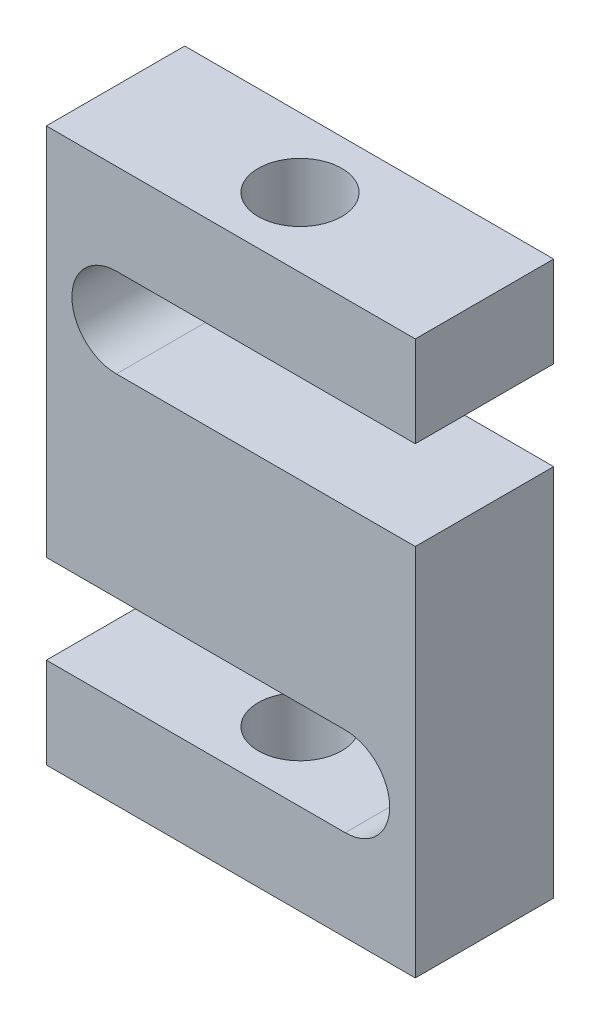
ISO-10303-21;
HEADER;
FILE_DESCRIPTION(('STEP AP214'),'2;1');
FILE_NAME('part.step','',(''),(''),'','','');
FILE_SCHEMA(('AUTOMOTIVE_DESIGN { 1 0 10303 214 1 1 1 1 }'));
ENDSEC;
DATA;
#1=APPLICATION_CONTEXT('core data for automotive mechanical design processes');
#2=APPLICATION_PROTOCOL_DEFINITION('international standard','automotive_design',2000,#1);
#3=PRODUCT_CONTEXT('',#1,'mechanical');
#4=PRODUCT('Part','Part','',(#3));
#5=PRODUCT_RELATED_PRODUCT_CATEGORY('part','',(#4));
#6=PRODUCT_DEFINITION_FORMATION('','',#4);
#7=PRODUCT_DEFINITION_CONTEXT('part definition',#1,'design');
#8=PRODUCT_DEFINITION('design','',#6,#7);
#9=PRODUCT_DEFINITION_SHAPE('','',#8);
#10=(LENGTH_UNIT() NAMED_UNIT(*) SI_UNIT(.MILLI.,.METRE.));
#11=(NAMED_UNIT(*) PLANE_ANGLE_UNIT() SI_UNIT($,.RADIAN.));
#12=(NAMED_UNIT(*) SI_UNIT($,.STERADIAN.) SOLID_ANGLE_UNIT());
#13=UNCERTAINTY_MEASURE_WITH_UNIT(LENGTH_MEASURE(1.E-05),#10,'distance_accuracy_value','');
#14=(GEOMETRIC_REPRESENTATION_CONTEXT(3) GLOBAL_UNCERTAINTY_ASSIGNED_CONTEXT((#13)) GLOBAL_UNIT_ASSIGNED_CONTEXT((#10,
#11,#12)) REPRESENTATION_CONTEXT('',''));
#15=CARTESIAN_POINT('',(0.,0.,0.));
#16=DIRECTION('',(0.,0.,1.));
#17=DIRECTION('',(1.,0.,0.));
#18=AXIS2_PLACEMENT_3D('',#15,#16,#17);
#19=CARTESIAN_POINT('',(-25.4,-25.6,9.525));
#20=DIRECTION('',(1.,0.,0.));
#21=DIRECTION('',(0.,1.,0.));
#22=AXIS2_PLACEMENT_3D('',#19,#20,#21);
#23=PLANE('',#22);
#24=DIRECTION('',(0.,-1.,0.));
#25=VECTOR('',#24,1.);
#26=CARTESIAN_POINT('',(-25.4,-25.6,-9.525));
#27=LINE('',#26,#25);
#28=CARTESIAN_POINT('',(-25.4,-25.6,-9.525));
#29=VERTEX_POINT('',#28);
#30=CARTESIAN_POINT('',(-25.4,-38.1,-9.525));
#31=VERTEX_POINT('',#30);
#32=EDGE_CURVE('E155',#29,#31,#27,.T.);
#33=ORIENTED_EDGE('',*,*,#32,.T.);
#34=DIRECTION('',(0.,0.,-1.));
#35=VECTOR('',#34,1.);
#36=CARTESIAN_POINT('',(-25.4,-38.1,9.525));
#37=LINE('',#36,#35);
#38=CARTESIAN_POINT('',(-25.4,-38.1,9.525));
#39=VERTEX_POINT('',#38);
#40=EDGE_CURVE('E11',#39,#31,#37,.T.);
#41=ORIENTED_EDGE('',*,*,#40,.F.);
#42=DIRECTION('',(0.,-1.,0.));
#43=VECTOR('',#42,1.);
#44=CARTESIAN_POINT('',(-25.4,-25.6,9.525));
#45=LINE('',#44,#43);
#46=CARTESIAN_POINT('',(-25.4,-25.6,9.525));
#47=VERTEX_POINT('',#46);
#48=EDGE_CURVE('E178',#47,#39,#45,.T.);
#49=ORIENTED_EDGE('',*,*,#48,.F.);
#50=DIRECTION('',(0.,0.,-1.));
#51=VECTOR('',#50,1.);
#52=CARTESIAN_POINT('',(-25.4,-25.6,9.525));
#53=LINE('',#52,#51);
#54=EDGE_CURVE('E151',#47,#29,#53,.T.);
#55=ORIENTED_EDGE('',*,*,#54,.T.);
#56=EDGE_LOOP('',(#33,#41,#49,#55));
#57=FACE_BOUND('',#56,.T.);
#58=ADVANCED_FACE('F35',(#57),#23,.F.);
#59=CARTESIAN_POINT('',(-25.4,-38.1,9.525));
#60=DIRECTION('',(0.,1.,0.));
#61=DIRECTION('',(0.,0.,1.));
#62=AXIS2_PLACEMENT_3D('',#59,#60,#61);
#63=PLANE('',#62);
#64=CARTESIAN_POINT('',(0.,-38.1,0.));
#65=DIRECTION('',(0.,-1.,0.));
#66=DIRECTION('',(0.,0.,-1.));
#67=AXIS2_PLACEMENT_3D('',#64,#65,#66);
#68=CIRCLE('',#67,5.75436999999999);
#69=CARTESIAN_POINT('',(0.,-38.1,-5.75436999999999));
#70=VERTEX_POINT('',#69);
#71=EDGE_CURVE('E365',#70,#70,#68,.T.);
#72=ORIENTED_EDGE('',*,*,#71,.F.);
#73=EDGE_LOOP('',(#72));
#74=FACE_BOUND('',#73,.T.);
#75=DIRECTION('',(1.,0.,0.));
#76=VECTOR('',#75,1.);
#77=CARTESIAN_POINT('',(-25.4,-38.1,-9.525));
#78=LINE('',#77,#76);
#79=CARTESIAN_POINT('',(25.4,-38.1,-9.525));
#80=VERTEX_POINT('',#79);
#81=EDGE_CURVE('E158',#31,#80,#78,.T.);
#82=ORIENTED_EDGE('',*,*,#81,.T.);
#83=DIRECTION('',(0.,0.,-1.));
#84=VECTOR('',#83,1.);
#85=CARTESIAN_POINT('',(25.4,-38.1,9.525));
#86=LINE('',#85,#84);
#87=CARTESIAN_POINT('',(25.4,-38.1,9.525));
#88=VERTEX_POINT('',#87);
#89=EDGE_CURVE('E43',#88,#80,#86,.T.);
#90=ORIENTED_EDGE('',*,*,#89,.F.);
#91=DIRECTION('',(1.,0.,0.));
#92=VECTOR('',#91,1.);
#93=CARTESIAN_POINT('',(-25.4,-38.1,9.525));
#94=LINE('',#93,#92);
#95=EDGE_CURVE('E106',#39,#88,#94,.T.);
#96=ORIENTED_EDGE('',*,*,#95,.F.);
#97=ORIENTED_EDGE('',*,*,#40,.T.);
#98=EDGE_LOOP('',(#82,#90,#96,#97));
#99=FACE_BOUND('',#98,.T.);
#100=ADVANCED_FACE('F258',(#74,#99),#63,.F.);
#101=CARTESIAN_POINT('',(25.4,-38.1,9.525));
#102=DIRECTION('',(-1.,0.,0.));
#103=DIRECTION('',(0.,0.,1.));
#104=AXIS2_PLACEMENT_3D('',#101,#102,#103);
#105=PLANE('',#104);
#106=DIRECTION('',(0.,1.,0.));
#107=VECTOR('',#106,1.);
#108=CARTESIAN_POINT('',(25.4,-38.1,-9.525));
#109=LINE('',#108,#107);
#110=CARTESIAN_POINT('',(25.4,13.3499999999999,-9.525));
#111=VERTEX_POINT('',#110);
#112=EDGE_CURVE('E161',#80,#111,#109,.T.);
#113=ORIENTED_EDGE('',*,*,#112,.T.);
#114=DIRECTION('',(0.,0.,-1.));
#115=VECTOR('',#114,1.);
#116=CARTESIAN_POINT('',(25.4,13.3499999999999,9.525));
#117=LINE('',#116,#115);
#118=CARTESIAN_POINT('',(25.4,13.3499999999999,9.525));
#119=VERTEX_POINT('',#118);
#120=EDGE_CURVE('E197',#119,#111,#117,.T.);
#121=ORIENTED_EDGE('',*,*,#120,.F.);
#122=DIRECTION('',(0.,1.,0.));
#123=VECTOR('',#122,1.);
#124=CARTESIAN_POINT('',(25.4,-38.1,9.525));
#125=LINE('',#124,#123);
#126=EDGE_CURVE('E205',#88,#119,#125,.T.);
#127=ORIENTED_EDGE('',*,*,#126,.F.);
#128=ORIENTED_EDGE('',*,*,#89,.T.);
#129=EDGE_LOOP('',(#113,#121,#127,#128));
#130=FACE_BOUND('',#129,.T.);
#131=ADVANCED_FACE('F203',(#130),#105,.F.);
#132=CARTESIAN_POINT('',(-15.748,13.3499999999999,9.525));
#133=DIRECTION('',(0.,-1.,0.));
#134=DIRECTION('',(0.,0.,-1.));
#135=AXIS2_PLACEMENT_3D('',#132,#133,#134);
#136=PLANE('',#135);
#137=DIRECTION('',(-1.,0.,0.));
#138=VECTOR('',#137,1.);
#139=CARTESIAN_POINT('',(-15.748,13.3499999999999,-9.525));
#140=LINE('',#139,#138);
#141=CARTESIAN_POINT('',(-15.748,13.3499999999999,-9.525));
#142=VERTEX_POINT('',#141);
#143=EDGE_CURVE('E163',#111,#142,#140,.T.);
#144=ORIENTED_EDGE('',*,*,#143,.T.);
#145=DIRECTION('',(0.,0.,-1.));
#146=VECTOR('',#145,1.);
#147=CARTESIAN_POINT('',(-15.748,13.3499999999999,9.525));
#148=LINE('',#147,#146);
#149=CARTESIAN_POINT('',(-15.748,13.3499999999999,9.525));
#150=VERTEX_POINT('',#149);
#151=EDGE_CURVE('E194',#150,#142,#148,.T.);
#152=ORIENTED_EDGE('',*,*,#151,.F.);
#153=DIRECTION('',(-1.,0.,0.));
#154=VECTOR('',#153,1.);
#155=CARTESIAN_POINT('',(-15.748,13.3499999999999,9.525));
#156=LINE('',#155,#154);
#157=EDGE_CURVE('E223',#119,#150,#156,.T.);
#158=ORIENTED_EDGE('',*,*,#157,.F.);
#159=ORIENTED_EDGE('',*,*,#120,.T.);
#160=EDGE_LOOP('',(#144,#152,#158,#159));
#161=FACE_BOUND('',#160,.T.);
#162=ADVANCED_FACE('F214',(#161),#136,.F.);
#163=CARTESIAN_POINT('',(-15.748,19.475,9.525));
#164=DIRECTION('',(0.,0.,-1.));
#165=DIRECTION('',(-1.,0.,0.));
#166=AXIS2_PLACEMENT_3D('',#163,#164,#165);
#167=CYLINDRICAL_SURFACE('',#166,6.12500000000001);
#168=CARTESIAN_POINT('',(-15.748,19.475,-9.525));
#169=DIRECTION('',(0.,0.,-1.));
#170=DIRECTION('',(1.,0.,0.));
#171=AXIS2_PLACEMENT_3D('',#168,#169,#170);
#172=CIRCLE('',#171,6.12500000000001);
#173=CARTESIAN_POINT('',(-15.748,25.6,-9.525));
#174=VERTEX_POINT('',#173);
#175=EDGE_CURVE('E165',#142,#174,#172,.T.);
#176=ORIENTED_EDGE('',*,*,#175,.T.);
#177=DIRECTION('',(0.,0.,-1.));
#178=VECTOR('',#177,1.);
#179=CARTESIAN_POINT('',(-15.748,25.6,9.525));
#180=LINE('',#179,#178);
#181=CARTESIAN_POINT('',(-15.748,25.6,9.525));
#182=VERTEX_POINT('',#181);
#183=EDGE_CURVE('E191',#182,#174,#180,.T.);
#184=ORIENTED_EDGE('',*,*,#183,.F.);
#185=CARTESIAN_POINT('',(-15.748,19.475,9.525));
#186=DIRECTION('',(0.,0.,-1.));
#187=DIRECTION('',(1.,0.,0.));
#188=AXIS2_PLACEMENT_3D('',#185,#186,#187);
#189=CIRCLE('',#188,6.12500000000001);
#190=EDGE_CURVE('E220',#150,#182,#189,.T.);
#191=ORIENTED_EDGE('',*,*,#190,.F.);
#192=ORIENTED_EDGE('',*,*,#151,.T.);
#193=EDGE_LOOP('',(#176,#184,#191,#192));
#194=FACE_BOUND('',#193,.T.);
#195=ADVANCED_FACE('F218',(#194),#167,.F.);
#196=CARTESIAN_POINT('',(-15.748,25.6,9.525));
#197=DIRECTION('',(0.,1.,0.));
#198=DIRECTION('',(-1.,0.,0.));
#199=AXIS2_PLACEMENT_3D('',#196,#197,#198);
#200=PLANE('',#199);
#201=CARTESIAN_POINT('',(0.,25.6,0.));
#202=DIRECTION('',(0.,1.,0.));
#203=DIRECTION('',(-1.,0.,0.));
#204=AXIS2_PLACEMENT_3D('',#201,#202,#203);
#205=CIRCLE('',#204,5.75436999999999);
#206=CARTESIAN_POINT('',(-5.75436999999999,25.6,0.));
#207=VERTEX_POINT('',#206);
#208=EDGE_CURVE('E159',#207,#207,#205,.T.);
#209=ORIENTED_EDGE('',*,*,#208,.T.);
#210=EDGE_LOOP('',(#209));
#211=FACE_BOUND('',#210,.T.);
#212=DIRECTION('',(1.,0.,0.));
#213=VECTOR('',#212,1.);
#214=CARTESIAN_POINT('',(-15.748,25.6,-9.525));
#215=LINE('',#214,#213);
#216=CARTESIAN_POINT('',(25.4,25.6,-9.525));
#217=VERTEX_POINT('',#216);
#218=EDGE_CURVE('E167',#174,#217,#215,.T.);
#219=ORIENTED_EDGE('',*,*,#218,.T.);
#220=DIRECTION('',(0.,0.,-1.));
#221=VECTOR('',#220,1.);
#222=CARTESIAN_POINT('',(25.4,25.6,9.525));
#223=LINE('',#222,#221);
#224=CARTESIAN_POINT('',(25.4,25.6,9.525));
#225=VERTEX_POINT('',#224);
#226=EDGE_CURVE('E188',#225,#217,#223,.T.);
#227=ORIENTED_EDGE('',*,*,#226,.F.);
#228=DIRECTION('',(1.,0.,0.));
#229=VECTOR('',#228,1.);
#230=CARTESIAN_POINT('',(-15.748,25.6,9.525));
#231=LINE('',#230,#229);
#232=EDGE_CURVE('E222',#182,#225,#231,.T.);
#233=ORIENTED_EDGE('',*,*,#232,.F.);
#234=ORIENTED_EDGE('',*,*,#183,.T.);
#235=EDGE_LOOP('',(#219,#227,#233,#234));
#236=FACE_BOUND('',#235,.T.);
#237=ADVANCED_FACE('F273',(#211,#236),#200,.F.);
#238=CARTESIAN_POINT('',(25.4,25.6,9.525));
#239=DIRECTION('',(-1.,0.,0.));
#240=DIRECTION('',(0.,-1.,0.));
#241=AXIS2_PLACEMENT_3D('',#238,#239,#240);
#242=PLANE('',#241);
#243=DIRECTION('',(0.,1.,0.));
#244=VECTOR('',#243,1.);
#245=CARTESIAN_POINT('',(25.4,25.6,-9.525));
#246=LINE('',#245,#244);
#247=CARTESIAN_POINT('',(25.4,38.1,-9.525));
#248=VERTEX_POINT('',#247);
#249=EDGE_CURVE('E169',#217,#248,#246,.T.);
#250=ORIENTED_EDGE('',*,*,#249,.T.);
#251=DIRECTION('',(0.,0.,-1.));
#252=VECTOR('',#251,1.);
#253=CARTESIAN_POINT('',(25.4,38.1,9.525));
#254=LINE('',#253,#252);
#255=CARTESIAN_POINT('',(25.4,38.1,9.525));
#256=VERTEX_POINT('',#255);
#257=EDGE_CURVE('E185',#256,#248,#254,.T.);
#258=ORIENTED_EDGE('',*,*,#257,.F.);
#259=DIRECTION('',(0.,1.,0.));
#260=VECTOR('',#259,1.);
#261=CARTESIAN_POINT('',(25.4,25.6,9.525));
#262=LINE('',#261,#260);
#263=EDGE_CURVE('E225',#225,#256,#262,.T.);
#264=ORIENTED_EDGE('',*,*,#263,.F.);
#265=ORIENTED_EDGE('',*,*,#226,.T.);
#266=EDGE_LOOP('',(#250,#258,#264,#265));
#267=FACE_BOUND('',#266,.T.);
#268=ADVANCED_FACE('F276',(#267),#242,.F.);
#269=CARTESIAN_POINT('',(25.4,38.1,9.525));
#270=DIRECTION('',(0.,-1.,0.));
#271=DIRECTION('',(1.,0.,0.));
#272=AXIS2_PLACEMENT_3D('',#269,#270,#271);
#273=PLANE('',#272);
#274=CARTESIAN_POINT('',(0.,38.1,0.));
#275=DIRECTION('',(0.,1.,0.));
#276=DIRECTION('',(0.,0.,1.));
#277=AXIS2_PLACEMENT_3D('',#274,#275,#276);
#278=CIRCLE('',#277,5.75436999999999);
#279=CARTESIAN_POINT('',(0.,38.1,5.75436999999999));
#280=VERTEX_POINT('',#279);
#281=EDGE_CURVE('E367',#280,#280,#278,.T.);
#282=ORIENTED_EDGE('',*,*,#281,.F.);
#283=EDGE_LOOP('',(#282));
#284=FACE_BOUND('',#283,.T.);
#285=DIRECTION('',(-1.,0.,0.));
#286=VECTOR('',#285,1.);
#287=CARTESIAN_POINT('',(25.4,38.1,-9.525));
#288=LINE('',#287,#286);
#289=CARTESIAN_POINT('',(-25.4,38.1,-9.525));
#290=VERTEX_POINT('',#289);
#291=EDGE_CURVE('E171',#248,#290,#288,.T.);
#292=ORIENTED_EDGE('',*,*,#291,.T.);
#293=DIRECTION('',(0.,0.,-1.));
#294=VECTOR('',#293,1.);
#295=CARTESIAN_POINT('',(-25.4,38.1,9.525));
#296=LINE('',#295,#294);
#297=CARTESIAN_POINT('',(-25.4,38.1,9.525));
#298=VERTEX_POINT('',#297);
#299=EDGE_CURVE('E182',#298,#290,#296,.T.);
#300=ORIENTED_EDGE('',*,*,#299,.F.);
#301=DIRECTION('',(-1.,0.,0.));
#302=VECTOR('',#301,1.);
#303=CARTESIAN_POINT('',(25.4,38.1,9.525));
#304=LINE('',#303,#302);
#305=EDGE_CURVE('E231',#256,#298,#304,.T.);
#306=ORIENTED_EDGE('',*,*,#305,.F.);
#307=ORIENTED_EDGE('',*,*,#257,.T.);
#308=EDGE_LOOP('',(#292,#300,#306,#307));
#309=FACE_BOUND('',#308,.T.);
#310=ADVANCED_FACE('F237',(#284,#309),#273,.F.);
#311=CARTESIAN_POINT('',(-25.4,38.1,9.525));
#312=DIRECTION('',(1.,0.,0.));
#313=DIRECTION('',(0.,1.,0.));
#314=AXIS2_PLACEMENT_3D('',#311,#312,#313);
#315=PLANE('',#314);
#316=DIRECTION('',(0.,-1.,0.));
#317=VECTOR('',#316,1.);
#318=CARTESIAN_POINT('',(-25.4,38.1,-9.525));
#319=LINE('',#318,#317);
#320=CARTESIAN_POINT('',(-25.4,-13.35,-9.525));
#321=VERTEX_POINT('',#320);
#322=EDGE_CURVE('E173',#290,#321,#319,.T.);
#323=ORIENTED_EDGE('',*,*,#322,.T.);
#324=DIRECTION('',(0.,0.,-1.));
#325=VECTOR('',#324,1.);
#326=CARTESIAN_POINT('',(-25.4,-13.35,9.525));
#327=LINE('',#326,#325);
#328=CARTESIAN_POINT('',(-25.4,-13.35,9.525));
#329=VERTEX_POINT('',#328);
#330=EDGE_CURVE('E146',#329,#321,#327,.T.);
#331=ORIENTED_EDGE('',*,*,#330,.F.);
#332=DIRECTION('',(0.,-1.,0.));
#333=VECTOR('',#332,1.);
#334=CARTESIAN_POINT('',(-25.4,38.1,9.525));
#335=LINE('',#334,#333);
#336=EDGE_CURVE('E137',#298,#329,#335,.T.);
#337=ORIENTED_EDGE('',*,*,#336,.F.);
#338=ORIENTED_EDGE('',*,*,#299,.T.);
#339=EDGE_LOOP('',(#323,#331,#337,#338));
#340=FACE_BOUND('',#339,.T.);
#341=ADVANCED_FACE('F241',(#340),#315,.F.);
#342=CARTESIAN_POINT('',(-25.4,-13.35,9.525));
#343=DIRECTION('',(0.,1.,0.));
#344=DIRECTION('',(-1.,0.,0.));
#345=AXIS2_PLACEMENT_3D('',#342,#343,#344);
#346=PLANE('',#345);
#347=DIRECTION('',(1.,0.,0.));
#348=VECTOR('',#347,1.);
#349=CARTESIAN_POINT('',(-25.4,-13.35,-9.525));
#350=LINE('',#349,#348);
#351=CARTESIAN_POINT('',(15.748,-13.35,-9.525));
#352=VERTEX_POINT('',#351);
#353=EDGE_CURVE('E145',#321,#352,#350,.T.);
#354=ORIENTED_EDGE('',*,*,#353,.T.);
#355=DIRECTION('',(0.,0.,-1.));
#356=VECTOR('',#355,1.);
#357=CARTESIAN_POINT('',(15.748,-13.35,9.525));
#358=LINE('',#357,#356);
#359=CARTESIAN_POINT('',(15.748,-13.35,9.525));
#360=VERTEX_POINT('',#359);
#361=EDGE_CURVE('E142',#360,#352,#358,.T.);
#362=ORIENTED_EDGE('',*,*,#361,.F.);
#363=DIRECTION('',(1.,0.,0.));
#364=VECTOR('',#363,1.);
#365=CARTESIAN_POINT('',(-25.4,-13.35,9.525));
#366=LINE('',#365,#364);
#367=EDGE_CURVE('E131',#329,#360,#366,.T.);
#368=ORIENTED_EDGE('',*,*,#367,.F.);
#369=ORIENTED_EDGE('',*,*,#330,.T.);
#370=EDGE_LOOP('',(#354,#362,#368,#369));
#371=FACE_BOUND('',#370,.T.);
#372=ADVANCED_FACE('F143',(#371),#346,.F.);
#373=CARTESIAN_POINT('',(15.748,-19.475,9.525));
#374=DIRECTION('',(0.,0.,-1.));
#375=DIRECTION('',(-1.,0.,0.));
#376=AXIS2_PLACEMENT_3D('',#373,#374,#375);
#377=CYLINDRICAL_SURFACE('',#376,6.12500000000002);
#378=CARTESIAN_POINT('',(15.748,-19.475,-9.525));
#379=DIRECTION('',(0.,0.,-1.));
#380=DIRECTION('',(1.,0.,0.));
#381=AXIS2_PLACEMENT_3D('',#378,#379,#380);
#382=CIRCLE('',#381,6.12500000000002);
#383=CARTESIAN_POINT('',(15.748,-25.6,-9.525));
#384=VERTEX_POINT('',#383);
#385=EDGE_CURVE('E92',#352,#384,#382,.T.);
#386=ORIENTED_EDGE('',*,*,#385,.T.);
#387=DIRECTION('',(0.,0.,-1.));
#388=VECTOR('',#387,1.);
#389=CARTESIAN_POINT('',(15.748,-25.6,9.525));
#390=LINE('',#389,#388);
#391=CARTESIAN_POINT('',(15.748,-25.6,9.525));
#392=VERTEX_POINT('',#391);
#393=EDGE_CURVE('E147',#392,#384,#390,.T.);
#394=ORIENTED_EDGE('',*,*,#393,.F.);
#395=CARTESIAN_POINT('',(15.748,-19.475,9.525));
#396=DIRECTION('',(0.,0.,-1.));
#397=DIRECTION('',(1.,0.,0.));
#398=AXIS2_PLACEMENT_3D('',#395,#396,#397);
#399=CIRCLE('',#398,6.12500000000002);
#400=EDGE_CURVE('E135',#360,#392,#399,.T.);
#401=ORIENTED_EDGE('',*,*,#400,.F.);
#402=ORIENTED_EDGE('',*,*,#361,.T.);
#403=EDGE_LOOP('',(#386,#394,#401,#402));
#404=FACE_BOUND('',#403,.T.);
#405=ADVANCED_FACE('F149',(#404),#377,.F.);
#406=CARTESIAN_POINT('',(-25.4,-25.6,9.525));
#407=DIRECTION('',(0.,-1.,0.));
#408=DIRECTION('',(1.,0.,0.));
#409=AXIS2_PLACEMENT_3D('',#406,#407,#408);
#410=PLANE('',#409);
#411=CARTESIAN_POINT('',(0.,-25.6,0.));
#412=DIRECTION('',(0.,-1.,0.));
#413=DIRECTION('',(1.,0.,0.));
#414=AXIS2_PLACEMENT_3D('',#411,#412,#413);
#415=CIRCLE('',#414,5.75436999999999);
#416=CARTESIAN_POINT('',(5.75436999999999,-25.6,0.));
#417=VERTEX_POINT('',#416);
#418=EDGE_CURVE('E363',#417,#417,#415,.T.);
#419=ORIENTED_EDGE('',*,*,#418,.T.);
#420=EDGE_LOOP('',(#419));
#421=FACE_BOUND('',#420,.T.);
#422=DIRECTION('',(-1.,0.,0.));
#423=VECTOR('',#422,1.);
#424=CARTESIAN_POINT('',(-25.4,-25.6,-9.525));
#425=LINE('',#424,#423);
#426=EDGE_CURVE('E98',#384,#29,#425,.T.);
#427=ORIENTED_EDGE('',*,*,#426,.T.);
#428=ORIENTED_EDGE('',*,*,#54,.F.);
#429=DIRECTION('',(-1.,0.,0.));
#430=VECTOR('',#429,1.);
#431=CARTESIAN_POINT('',(-25.4,-25.6,9.525));
#432=LINE('',#431,#430);
#433=EDGE_CURVE('E51',#392,#47,#432,.T.);
#434=ORIENTED_EDGE('',*,*,#433,.F.);
#435=ORIENTED_EDGE('',*,*,#393,.T.);
#436=EDGE_LOOP('',(#427,#428,#434,#435));
#437=FACE_BOUND('',#436,.T.);
#438=ADVANCED_FACE('F245',(#421,#437),#410,.F.);
#439=CARTESIAN_POINT('',(-15.748,19.475,9.525));
#440=DIRECTION('',(0.,0.,1.));
#441=DIRECTION('',(1.,0.,0.));
#442=AXIS2_PLACEMENT_3D('',#439,#440,#441);
#443=PLANE('',#442);
#444=ORIENTED_EDGE('',*,*,#48,.T.);
#445=ORIENTED_EDGE('',*,*,#95,.T.);
#446=ORIENTED_EDGE('',*,*,#126,.T.);
#447=ORIENTED_EDGE('',*,*,#157,.T.);
#448=ORIENTED_EDGE('',*,*,#190,.T.);
#449=ORIENTED_EDGE('',*,*,#232,.T.);
#450=ORIENTED_EDGE('',*,*,#263,.T.);
#451=ORIENTED_EDGE('',*,*,#305,.T.);
#452=ORIENTED_EDGE('',*,*,#336,.T.);
#453=ORIENTED_EDGE('',*,*,#367,.T.);
#454=ORIENTED_EDGE('',*,*,#400,.T.);
#455=ORIENTED_EDGE('',*,*,#433,.T.);
#456=EDGE_LOOP('',(#444,#445,#446,#447,#448,#449,#450,#451,#452,#453,#454,#455));
#457=FACE_BOUND('',#456,.T.);
#458=ADVANCED_FACE('F133',(#457),#443,.T.);
#459=CARTESIAN_POINT('',(-15.748,19.475,-9.525));
#460=DIRECTION('',(0.,0.,1.));
#461=DIRECTION('',(1.,0.,0.));
#462=AXIS2_PLACEMENT_3D('',#459,#460,#461);
#463=PLANE('',#462);
#464=ORIENTED_EDGE('',*,*,#32,.F.);
#465=ORIENTED_EDGE('',*,*,#426,.F.);
#466=ORIENTED_EDGE('',*,*,#385,.F.);
#467=ORIENTED_EDGE('',*,*,#353,.F.);
#468=ORIENTED_EDGE('',*,*,#322,.F.);
#469=ORIENTED_EDGE('',*,*,#291,.F.);
#470=ORIENTED_EDGE('',*,*,#249,.F.);
#471=ORIENTED_EDGE('',*,*,#218,.F.);
#472=ORIENTED_EDGE('',*,*,#175,.F.);
#473=ORIENTED_EDGE('',*,*,#143,.F.);
#474=ORIENTED_EDGE('',*,*,#112,.F.);
#475=ORIENTED_EDGE('',*,*,#81,.F.);
#476=EDGE_LOOP('',(#464,#465,#466,#467,#468,#469,#470,#471,#472,#473,#474,#475));
#477=FACE_BOUND('',#476,.T.);
#478=ADVANCED_FACE('F209',(#477),#463,.F.);
#479=CARTESIAN_POINT('',(0.,38.1,0.));
#480=DIRECTION('',(0.,1.,0.));
#481=DIRECTION('',(0.,0.,1.));
#482=AXIS2_PLACEMENT_3D('',#479,#480,#481);
#483=CYLINDRICAL_SURFACE('',#482,5.75436999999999);
#484=ORIENTED_EDGE('',*,*,#208,.F.);
#485=EDGE_LOOP('',(#484));
#486=FACE_BOUND('',#485,.T.);
#487=ORIENTED_EDGE('',*,*,#281,.T.);
#488=EDGE_LOOP('',(#487));
#489=FACE_BOUND('',#488,.T.);
#490=ADVANCED_FACE('F311',(#486,#489),#483,.F.);
#491=CARTESIAN_POINT('',(0.,-38.1,0.));
#492=DIRECTION('',(0.,-1.,0.));
#493=DIRECTION('',(0.,0.,-1.));
#494=AXIS2_PLACEMENT_3D('',#491,#492,#493);
#495=CYLINDRICAL_SURFACE('',#494,5.75436999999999);
#496=ORIENTED_EDGE('',*,*,#418,.F.);
#497=EDGE_LOOP('',(#496));
#498=FACE_BOUND('',#497,.T.);
#499=ORIENTED_EDGE('',*,*,#71,.T.);
#500=EDGE_LOOP('',(#499));
#501=FACE_BOUND('',#500,.T.);
#502=ADVANCED_FACE('F334',(#498,#501),#495,.F.);
#503=CLOSED_SHELL('',(#58,#100,#131,#162,#195,#237,#268,#310,#341,#372,#405,#438,#458,#478,#490,#502));
#504=MANIFOLD_SOLID_BREP('B2',#503);
#505=ADVANCED_BREP_SHAPE_REPRESENTATION('',(#18,#504),#14);
#506=SHAPE_DEFINITION_REPRESENTATION(#9,#505);
ENDSEC;
END-ISO-10303-21;
